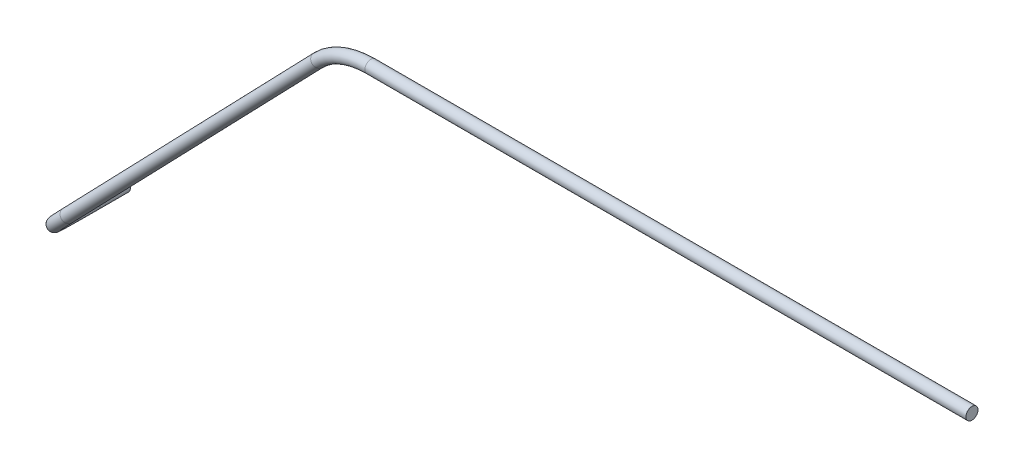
ISO-10303-21;
HEADER;
FILE_DESCRIPTION(('STEP AP214'),'2;1');
FILE_NAME('part.step','',(''),(''),'','','');
FILE_SCHEMA(('AUTOMOTIVE_DESIGN { 1 0 10303 214 1 1 1 1 }'));
ENDSEC;
DATA;
#1=APPLICATION_CONTEXT('core data for automotive mechanical design processes');
#2=APPLICATION_PROTOCOL_DEFINITION('international standard','automotive_design',2000,#1);
#3=PRODUCT_CONTEXT('',#1,'mechanical');
#4=PRODUCT('Part','Part','',(#3));
#5=PRODUCT_RELATED_PRODUCT_CATEGORY('part','',(#4));
#6=PRODUCT_DEFINITION_FORMATION('','',#4);
#7=PRODUCT_DEFINITION_CONTEXT('part definition',#1,'design');
#8=PRODUCT_DEFINITION('design','',#6,#7);
#9=PRODUCT_DEFINITION_SHAPE('','',#8);
#10=(LENGTH_UNIT() NAMED_UNIT(*) SI_UNIT(.MILLI.,.METRE.));
#11=(NAMED_UNIT(*) PLANE_ANGLE_UNIT() SI_UNIT($,.RADIAN.));
#12=(NAMED_UNIT(*) SI_UNIT($,.STERADIAN.) SOLID_ANGLE_UNIT());
#13=UNCERTAINTY_MEASURE_WITH_UNIT(LENGTH_MEASURE(1.E-05),#10,'distance_accuracy_value','');
#14=(GEOMETRIC_REPRESENTATION_CONTEXT(3) GLOBAL_UNCERTAINTY_ASSIGNED_CONTEXT((#13)) GLOBAL_UNIT_ASSIGNED_CONTEXT((#10,
#11,#12)) REPRESENTATION_CONTEXT('',''));
#15=CARTESIAN_POINT('',(0.,0.,0.));
#16=DIRECTION('',(0.,0.,1.));
#17=DIRECTION('',(1.,0.,0.));
#18=AXIS2_PLACEMENT_3D('',#15,#16,#17);
#19=CARTESIAN_POINT('',(300.681024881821,309.727599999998,106.04244285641));
#20=DIRECTION('',(1.,0.,0.));
#21=DIRECTION('',(0.,0.,-1.));
#22=AXIS2_PLACEMENT_3D('',#19,#20,#21);
#23=CYLINDRICAL_SURFACE('',#22,4.76249999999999);
#24=CARTESIAN_POINT('',(300.681024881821,309.727599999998,106.04244285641));
#25=DIRECTION('',(1.,0.,0.));
#26=DIRECTION('',(0.,-0.698920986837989,-0.715198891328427));
#27=AXIS2_PLACEMENT_3D('',#24,#25,#26);
#28=CIRCLE('',#27,4.76249999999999);
#29=CARTESIAN_POINT('',(300.681024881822,314.470247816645,106.476836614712));
#30=VERTEX_POINT('',#29);
#31=EDGE_CURVE('E38',#30,#30,#28,.T.);
#32=ORIENTED_EDGE('',*,*,#31,.T.);
#33=EDGE_LOOP('',(#32));
#34=FACE_BOUND('',#33,.T.);
#35=CARTESIAN_POINT('',(775.177609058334,309.727599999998,106.04244285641));
#36=DIRECTION('',(1.,0.,0.));
#37=DIRECTION('',(0.,-0.698920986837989,-0.715198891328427));
#38=AXIS2_PLACEMENT_3D('',#35,#36,#37);
#39=CIRCLE('',#38,4.76249999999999);
#40=CARTESIAN_POINT('',(775.177609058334,306.398988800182,102.636308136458));
#41=VERTEX_POINT('',#40);
#42=EDGE_CURVE('E10',#41,#41,#39,.T.);
#43=ORIENTED_EDGE('',*,*,#42,.F.);
#44=EDGE_LOOP('',(#43));
#45=FACE_BOUND('',#44,.T.);
#46=ADVANCED_FACE('F32',(#34,#45),#23,.T.);
#47=CARTESIAN_POINT('',(300.68102488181,249.977706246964,100.569765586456));
#48=DIRECTION('',(0.,0.0912112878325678,-0.995831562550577));
#49=DIRECTION('',(0.,0.995831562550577,0.0912112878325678));
#50=AXIS2_PLACEMENT_3D('',#47,#48,#49);
#51=TOROIDAL_SURFACE('',#50,59.9999999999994,4.76249999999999);
#52=CARTESIAN_POINT('',(257.479550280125,291.441059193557,104.367522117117));
#53=DIRECTION('',(0.693948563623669,0.717023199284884,0.0656743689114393));
#54=DIRECTION('',(0.548112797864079,-0.466913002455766,-0.693948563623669));
#55=AXIS2_PLACEMENT_3D('',#52,#53,#54);
#56=CIRCLE('',#55,4.76249999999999);
#57=CARTESIAN_POINT('',(254.050433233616,294.732212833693,104.668969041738));
#58=VERTEX_POINT('',#57);
#59=EDGE_CURVE('E42',#58,#58,#56,.T.);
#60=CARTESIAN_POINT('',(300.68102488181,249.977706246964,100.569765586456));
#61=DIRECTION('',(0.,0.0912112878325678,-0.995831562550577));
#62=DIRECTION('',(0.,0.995831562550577,0.0912112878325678));
#63=AXIS2_PLACEMENT_3D('',#60,#61,#62);
#64=CIRCLE('',#63,64.7624999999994);
#65=EDGE_CURVE('',#58,#30,#64,.T.);
#66=ORIENTED_EDGE('',*,*,#59,.T.);
#67=ORIENTED_EDGE('',*,*,#31,.F.);
#68=ORIENTED_EDGE('',*,*,#65,.T.);
#69=ORIENTED_EDGE('',*,*,#65,.F.);
#70=EDGE_LOOP('',(#66,#68,#67,#69));
#71=FACE_BOUND('',#70,.T.);
#72=ADVANCED_FACE('F76',(#71),#51,.T.);
#73=CARTESIAN_POINT('',(38.9866036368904,65.6829557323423,83.6896403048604));
#74=DIRECTION('',(0.693948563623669,0.717023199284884,0.0656743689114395));
#75=DIRECTION('',(-0.718574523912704,0.695449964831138,0.));
#76=AXIS2_PLACEMENT_3D('',#73,#74,#75);
#77=CYLINDRICAL_SURFACE('',#76,4.76249999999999);
#78=CARTESIAN_POINT('',(38.9866036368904,65.6829557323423,83.6896403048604));
#79=DIRECTION('',(0.693948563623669,0.717023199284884,0.0656743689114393));
#80=DIRECTION('',(0.548112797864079,-0.466913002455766,-0.693948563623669));
#81=AXIS2_PLACEMENT_3D('',#78,#79,#80);
#82=CIRCLE('',#81,4.76249999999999);
#83=CARTESIAN_POINT('',(38.7690848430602,65.4582041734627,88.4418585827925));
#84=VERTEX_POINT('',#83);
#85=EDGE_CURVE('E46',#84,#84,#82,.T.);
#86=ORIENTED_EDGE('',*,*,#85,.T.);
#87=EDGE_LOOP('',(#86));
#88=FACE_BOUND('',#87,.T.);
#89=ORIENTED_EDGE('',*,*,#59,.F.);
#90=EDGE_LOOP('',(#89));
#91=FACE_BOUND('',#90,.T.);
#92=ADVANCED_FACE('F80',(#88,#91),#77,.T.);
#93=CARTESIAN_POINT('',(41.7269978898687,68.5144714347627,23.8191738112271));
#94=DIRECTION('',(-0.718574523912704,0.695449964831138,0.));
#95=DIRECTION('',(-0.695449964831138,-0.718574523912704,0.));
#96=AXIS2_PLACEMENT_3D('',#93,#94,#95);
#97=TOROIDAL_SURFACE('',#96,60.0000000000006,4.76249999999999);
#98=CARTESIAN_POINT('',(0.,25.4,23.8191738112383));
#99=DIRECTION('',(0.,0.,1.));
#100=DIRECTION('',(1.,0.,0.));
#101=AXIS2_PLACEMENT_3D('',#98,#99,#100);
#102=CIRCLE('',#101,4.76249999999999);
#103=CARTESIAN_POINT('',(-3.31208045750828,21.9777888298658,23.8191738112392));
#104=VERTEX_POINT('',#103);
#105=EDGE_CURVE('E51',#104,#104,#102,.T.);
#106=CARTESIAN_POINT('',(41.7269978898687,68.5144714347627,23.8191738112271));
#107=DIRECTION('',(-0.718574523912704,0.695449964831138,0.));
#108=DIRECTION('',(-0.695449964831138,-0.718574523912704,0.));
#109=AXIS2_PLACEMENT_3D('',#106,#107,#108);
#110=CIRCLE('',#109,64.7625000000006);
#111=EDGE_CURVE('',#104,#84,#110,.T.);
#112=ORIENTED_EDGE('',*,*,#105,.T.);
#113=ORIENTED_EDGE('',*,*,#85,.F.);
#114=ORIENTED_EDGE('',*,*,#111,.T.);
#115=ORIENTED_EDGE('',*,*,#111,.F.);
#116=EDGE_LOOP('',(#112,#114,#113,#115));
#117=FACE_BOUND('',#116,.T.);
#118=ADVANCED_FACE('F58',(#117),#97,.T.);
#119=CARTESIAN_POINT('',(0.,25.4,23.8191738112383));
#120=DIRECTION('',(0.,0.,-1.));
#121=DIRECTION('',(-1.,0.,0.));
#122=AXIS2_PLACEMENT_3D('',#119,#120,#121);
#123=CYLINDRICAL_SURFACE('',#122,4.76249999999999);
#124=ORIENTED_EDGE('',*,*,#105,.F.);
#125=EDGE_LOOP('',(#124));
#126=FACE_BOUND('',#125,.T.);
#127=CARTESIAN_POINT('',(0.,25.4,0.));
#128=DIRECTION('',(0.,0.,1.));
#129=DIRECTION('',(1.,0.,0.));
#130=AXIS2_PLACEMENT_3D('',#127,#128,#129);
#131=CIRCLE('',#130,4.76249999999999);
#132=CARTESIAN_POINT('',(4.76249999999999,25.4,0.));
#133=VERTEX_POINT('',#132);
#134=EDGE_CURVE('E52',#133,#133,#131,.T.);
#135=ORIENTED_EDGE('',*,*,#134,.T.);
#136=EDGE_LOOP('',(#135));
#137=FACE_BOUND('',#136,.T.);
#138=ADVANCED_FACE('F61',(#126,#137),#123,.T.);
#139=CARTESIAN_POINT('',(775.177609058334,309.727599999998,106.04244285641));
#140=DIRECTION('',(1.,0.,0.));
#141=DIRECTION('',(0.,-0.698920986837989,-0.715198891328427));
#142=AXIS2_PLACEMENT_3D('',#139,#140,#141);
#143=PLANE('',#142);
#144=ORIENTED_EDGE('',*,*,#42,.T.);
#145=EDGE_LOOP('',(#144));
#146=FACE_BOUND('',#145,.T.);
#147=ADVANCED_FACE('F64',(#146),#143,.T.);
#148=CARTESIAN_POINT('',(0.,25.4,0.));
#149=DIRECTION('',(0.,0.,1.));
#150=DIRECTION('',(1.,0.,0.));
#151=AXIS2_PLACEMENT_3D('',#148,#149,#150);
#152=PLANE('',#151);
#153=ORIENTED_EDGE('',*,*,#134,.F.);
#154=EDGE_LOOP('',(#153));
#155=FACE_BOUND('',#154,.T.);
#156=ADVANCED_FACE('F68',(#155),#152,.F.);
#157=CLOSED_SHELL('',(#46,#72,#92,#118,#138,#147,#156));
#158=MANIFOLD_SOLID_BREP('B2',#157);
#159=ADVANCED_BREP_SHAPE_REPRESENTATION('',(#18,#158),#14);
#160=SHAPE_DEFINITION_REPRESENTATION(#9,#159);
ENDSEC;
END-ISO-10303-21;
